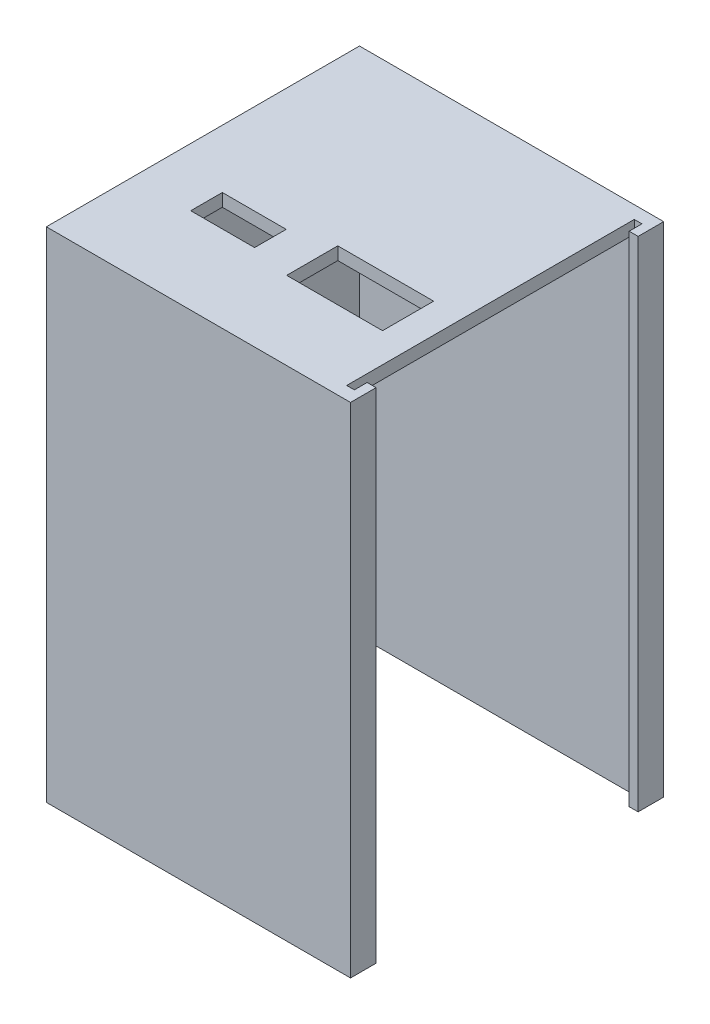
from build123d import *

# Parameters (mm, degrees)
SKETCH1_W           = 43
SKETCH1_H           = 45
BOSS_EXTRUDE1_DEPTH = 2
SKETCH3_W           = 15
SKETCH3_H           = 8
CUT_EXTRUDE1_DEPTH  = 2
SKETCH4_W           = 2
SKETCH4_H           = 45
BOSS_EXTRUDE2_DEPTH = 78
SKETCH5_W           = 46.2
SKETCH5_H           = 2
BOSS_EXTRUDE3_DEPTH = 78
SKETCH6_W           = 46.2
SKETCH6_H           = 2
BOSS_EXTRUDE4_DEPTH = 78
SKETCH7_W           = 4
SKETCH7_H           = 77.988453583
BOSS_EXTRUDE5_DEPTH = 1.4
SKETCH8_W           = 4
SKETCH8_H           = 78
BOSS_EXTRUDE6_DEPTH = 1.4


with BuildPart() as part:
    # Sketch1 → Boss-Extrude1 (new body)
    with BuildSketch(Plane(origin=(0, 0, 0), x_dir=(1, 0, 0), z_dir=(0, 1, 0))):
        Rectangle(SKETCH1_W, SKETCH1_H)
    extrude(amount=-BOSS_EXTRUDE1_DEPTH)

    # Sketch3 → Cut-Extrude1 (cut)
    with BuildSketch(Plane(origin=(0, -2, 0), x_dir=(-1, 0, 0), z_dir=(0, -1, 0))):
        with Locations((-9.383452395, -8.276472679)):
            Rectangle(SKETCH3_W, SKETCH3_H)
        Polygon((4.387276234, -6.080963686), (14.379628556, -6.080963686), (14.379628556, -10.080963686), (14.379628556, -11.024401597), (4.387276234, -11.024401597), (4.387276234, -10.471981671), align=None)
    extrude(amount=-CUT_EXTRUDE1_DEPTH, mode=Mode.SUBTRACT)

    # Sketch4 → Boss-Extrude2 (add)
    with BuildSketch(Plane(origin=(0, 0, 0), x_dir=(1, 0, 0), z_dir=(0, 1, 0))):
        with Locations((-22.5, 0)):
            Rectangle(SKETCH4_W, SKETCH4_H)
    extrude(amount=-BOSS_EXTRUDE2_DEPTH)

    # Sketch5 → Boss-Extrude3 (add)
    with BuildSketch(Plane(origin=(0, 0, 0), x_dir=(1, 0, 0), z_dir=(0, 1, 0))):
        with Locations((-0.4, 23.5)):
            Rectangle(SKETCH5_W, SKETCH5_H)
    extrude(amount=-BOSS_EXTRUDE3_DEPTH)

    # Sketch6 → Boss-Extrude4 (add)
    with BuildSketch(Plane(origin=(0, 0, 0), x_dir=(1, 0, 0), z_dir=(0, 1, 0))):
        with Locations((-0.4, -23.5)):
            Rectangle(SKETCH6_W, SKETCH6_H)
    extrude(amount=-BOSS_EXTRUDE4_DEPTH)

    # Sketch7 → Boss-Extrude5 (add)
    with BuildSketch(Plane(origin=(22.7, 0, 0), x_dir=(0, 0, -1), z_dir=(1, 0, 0))):
        with Locations((22.5, -38.994226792)):
            Rectangle(SKETCH7_W, SKETCH7_H)
    extrude(amount=BOSS_EXTRUDE5_DEPTH)

    # Sketch8 → Boss-Extrude6 (add)
    with BuildSketch(Plane(origin=(22.7, 0, 0), x_dir=(0, 0, -1), z_dir=(1, 0, 0))):
        with Locations((-22.5, -39)):
            Rectangle(SKETCH8_W, SKETCH8_H)
    extrude(amount=BOSS_EXTRUDE6_DEPTH)


solid = part.part
